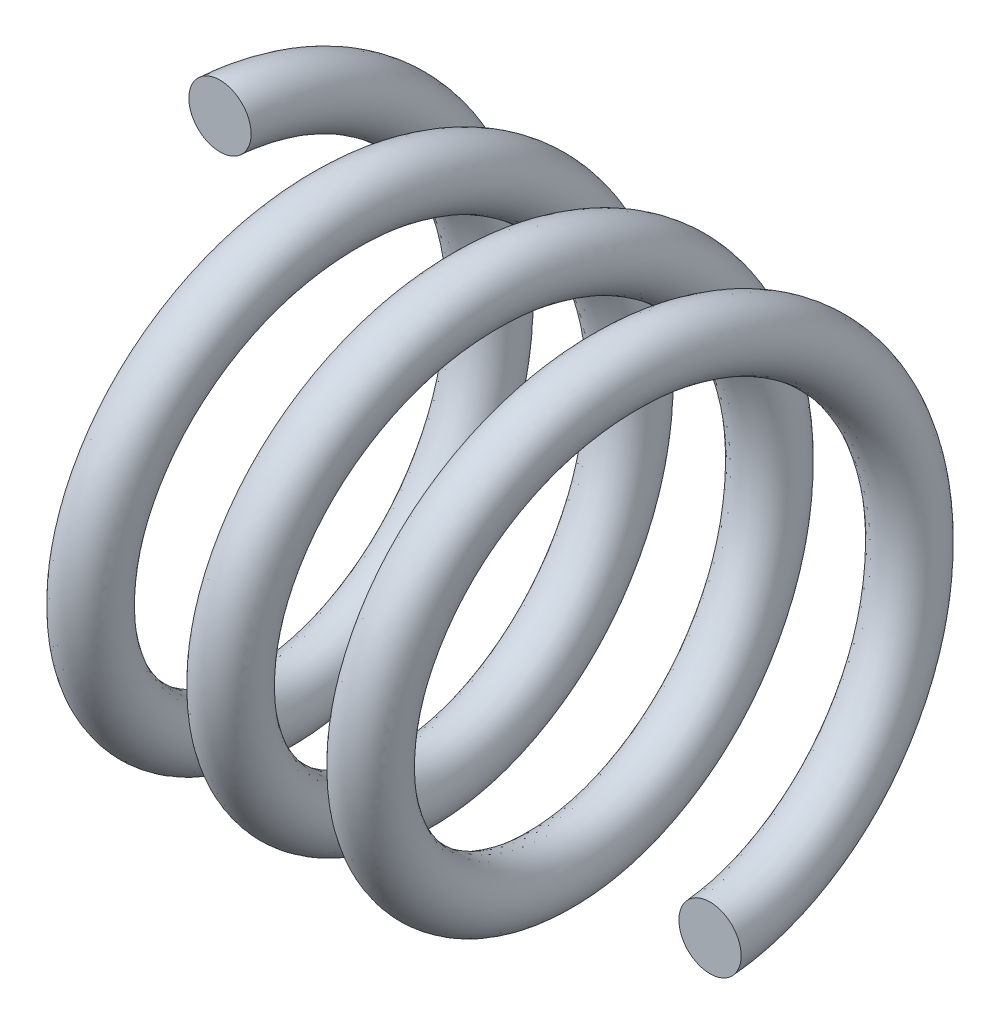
from build123d import *

# Parameters (mm, degrees)
BASE_BALAYAGE_PITCH       = 4.5
BASE_BALAYAGE_HEIGHT      = 15.75
BASE_BALAYAGE_RADIUS      = 7.5
BASE_BALAYAGE_START_ANGLE = -90
ESQUISSE1_R               = 1


with BuildPart() as part:
    # Base-Balayage: sweep along a helix
    with BuildLine() as base_balayage_path:
        add(Helix(BASE_BALAYAGE_PITCH, BASE_BALAYAGE_HEIGHT, BASE_BALAYAGE_RADIUS, center=(0, 0, 0), direction=(1, 0, 0), lefthand=True, mode=Mode.PRIVATE).rotate(Axis((0, 0, 0), (1, 0, 0)), BASE_BALAYAGE_START_ANGLE))
    # Esquisse1 → Base-Balayage (sweep)
    with BuildSketch(Plane.XY):
        with Locations((0, 7.5)):
            Circle(ESQUISSE1_R)
    sweep(path=base_balayage_path.line, is_frenet=True)


solid = part.part
